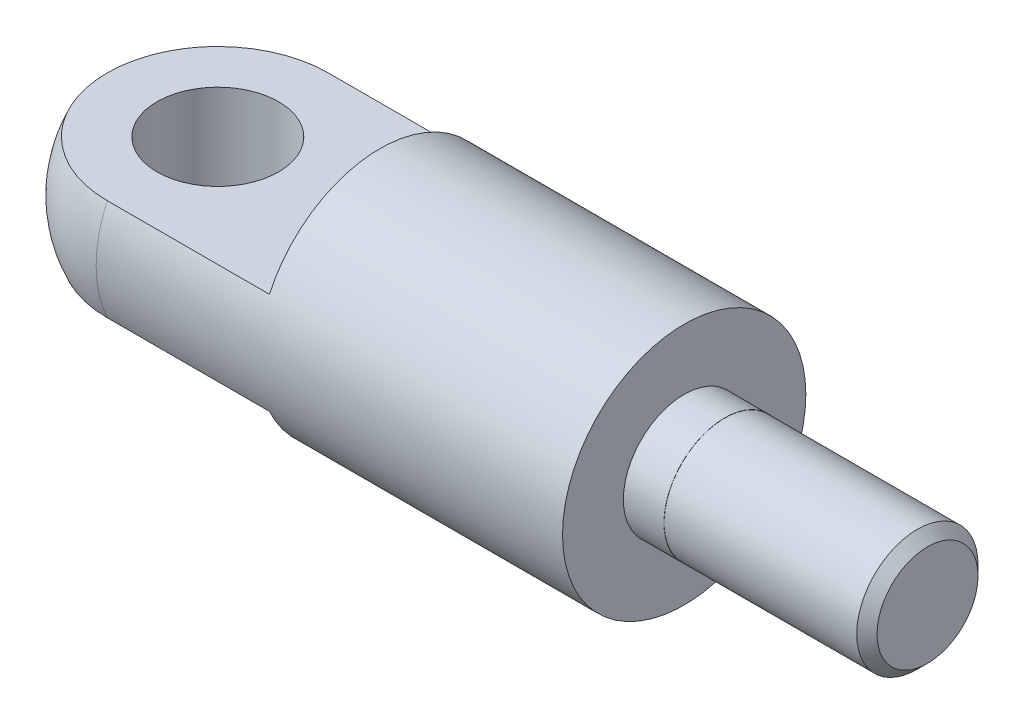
ISO-10303-21;
HEADER;
FILE_DESCRIPTION(('STEP AP214'),'2;1');
FILE_NAME('part.step','',(''),(''),'','','');
FILE_SCHEMA(('AUTOMOTIVE_DESIGN { 1 0 10303 214 1 1 1 1 }'));
ENDSEC;
DATA;
#1=APPLICATION_CONTEXT('core data for automotive mechanical design processes');
#2=APPLICATION_PROTOCOL_DEFINITION('international standard','automotive_design',2000,#1);
#3=PRODUCT_CONTEXT('',#1,'mechanical');
#4=PRODUCT('Part','Part','',(#3));
#5=PRODUCT_RELATED_PRODUCT_CATEGORY('part','',(#4));
#6=PRODUCT_DEFINITION_FORMATION('','',#4);
#7=PRODUCT_DEFINITION_CONTEXT('part definition',#1,'design');
#8=PRODUCT_DEFINITION('design','',#6,#7);
#9=PRODUCT_DEFINITION_SHAPE('','',#8);
#10=(LENGTH_UNIT() NAMED_UNIT(*) SI_UNIT(.MILLI.,.METRE.));
#11=(NAMED_UNIT(*) PLANE_ANGLE_UNIT() SI_UNIT($,.RADIAN.));
#12=(NAMED_UNIT(*) SI_UNIT($,.STERADIAN.) SOLID_ANGLE_UNIT());
#13=UNCERTAINTY_MEASURE_WITH_UNIT(LENGTH_MEASURE(1.E-05),#10,'distance_accuracy_value','');
#14=(GEOMETRIC_REPRESENTATION_CONTEXT(3) GLOBAL_UNCERTAINTY_ASSIGNED_CONTEXT((#13)) GLOBAL_UNIT_ASSIGNED_CONTEXT((#10,
#11,#12)) REPRESENTATION_CONTEXT('',''));
#15=CARTESIAN_POINT('',(0.,0.,0.));
#16=DIRECTION('',(0.,0.,1.));
#17=DIRECTION('',(1.,0.,0.));
#18=AXIS2_PLACEMENT_3D('',#15,#16,#17);
#19=CARTESIAN_POINT('',(0.,0.,0.));
#20=DIRECTION('',(-1.,0.,0.));
#21=DIRECTION('',(0.,0.,1.));
#22=AXIS2_PLACEMENT_3D('',#19,#20,#21);
#23=CYLINDRICAL_SURFACE('',#22,2.99999999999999);
#24=CARTESIAN_POINT('',(29.,0.,0.));
#25=DIRECTION('',(-1.,0.,0.));
#26=DIRECTION('',(0.,0.,1.));
#27=AXIS2_PLACEMENT_3D('',#24,#25,#26);
#28=CIRCLE('',#27,2.99999999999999);
#29=CARTESIAN_POINT('',(29.,0.,2.99999999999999));
#30=VERTEX_POINT('',#29);
#31=EDGE_CURVE('E173',#30,#30,#28,.T.);
#32=ORIENTED_EDGE('',*,*,#31,.F.);
#33=EDGE_LOOP('',(#32));
#34=FACE_BOUND('',#33,.T.);
#35=CARTESIAN_POINT('',(31.,0.,0.));
#36=DIRECTION('',(1.,0.,0.));
#37=DIRECTION('',(0.,0.,-1.));
#38=AXIS2_PLACEMENT_3D('',#35,#36,#37);
#39=CIRCLE('',#38,2.99999999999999);
#40=CARTESIAN_POINT('',(31.,0.,-2.99999999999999));
#41=VERTEX_POINT('',#40);
#42=EDGE_CURVE('E95',#41,#41,#39,.T.);
#43=ORIENTED_EDGE('',*,*,#42,.F.);
#44=EDGE_LOOP('',(#43));
#45=FACE_BOUND('',#44,.T.);
#46=ADVANCED_FACE('F32',(#34,#45),#23,.T.);
#47=CARTESIAN_POINT('',(6.,0.,0.));
#48=DIRECTION('',(-1.,0.,0.));
#49=DIRECTION('',(0.,0.,-1.));
#50=AXIS2_PLACEMENT_3D('',#47,#48,#49);
#51=SPHERICAL_SURFACE('',#50,6.);
#52=CARTESIAN_POINT('',(6.,0.,0.));
#53=DIRECTION('',(-1.,0.,0.));
#54=DIRECTION('',(0.,0.,1.));
#55=AXIS2_PLACEMENT_3D('',#52,#53,#54);
#56=CIRCLE('',#55,5.99999999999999);
#57=CARTESIAN_POINT('',(6.,-2.5,5.45435605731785));
#58=VERTEX_POINT('',#57);
#59=CARTESIAN_POINT('',(6.,2.5,5.45435605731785));
#60=VERTEX_POINT('',#59);
#61=EDGE_CURVE('E168',#58,#60,#56,.T.);
#62=ORIENTED_EDGE('',*,*,#61,.T.);
#63=CARTESIAN_POINT('',(6.,2.5,0.));
#64=DIRECTION('',(0.,-1.,0.));
#65=DIRECTION('',(0.,0.,-1.));
#66=AXIS2_PLACEMENT_3D('',#63,#64,#65);
#67=CIRCLE('',#66,5.45435605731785);
#68=CARTESIAN_POINT('',(6.,2.5,-5.45435605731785));
#69=VERTEX_POINT('',#68);
#70=EDGE_CURVE('E74',#60,#69,#67,.T.);
#71=ORIENTED_EDGE('',*,*,#70,.T.);
#72=CARTESIAN_POINT('',(6.,-2.5,-5.45435605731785));
#73=VERTEX_POINT('',#72);
#74=EDGE_CURVE('E167',#69,#73,#56,.T.);
#75=ORIENTED_EDGE('',*,*,#74,.T.);
#76=CARTESIAN_POINT('',(6.,-2.5,0.));
#77=DIRECTION('',(0.,1.,0.));
#78=DIRECTION('',(0.,0.,1.));
#79=AXIS2_PLACEMENT_3D('',#76,#77,#78);
#80=CIRCLE('',#79,5.45435605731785);
#81=EDGE_CURVE('E164',#73,#58,#80,.T.);
#82=ORIENTED_EDGE('',*,*,#81,.T.);
#83=EDGE_LOOP('',(#62,#71,#75,#82));
#84=FACE_BOUND('',#83,.T.);
#85=ADVANCED_FACE('F113',(#84),#51,.T.);
#86=CARTESIAN_POINT('',(29.,0.,-2.99999999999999));
#87=DIRECTION('',(-1.,0.,0.));
#88=DIRECTION('',(0.,0.,1.));
#89=AXIS2_PLACEMENT_3D('',#86,#87,#88);
#90=PLANE('',#89);
#91=CARTESIAN_POINT('',(29.,0.,0.));
#92=DIRECTION('',(-1.,0.,0.));
#93=DIRECTION('',(0.,0.,1.));
#94=AXIS2_PLACEMENT_3D('',#91,#92,#93);
#95=CIRCLE('',#94,5.99999999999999);
#96=CARTESIAN_POINT('',(29.,0.,5.99999999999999));
#97=VERTEX_POINT('',#96);
#98=EDGE_CURVE('E170',#97,#97,#95,.T.);
#99=ORIENTED_EDGE('',*,*,#98,.F.);
#100=EDGE_LOOP('',(#99));
#101=FACE_BOUND('',#100,.T.);
#102=ORIENTED_EDGE('',*,*,#31,.T.);
#103=EDGE_LOOP('',(#102));
#104=FACE_BOUND('',#103,.T.);
#105=ADVANCED_FACE('F119',(#101,#104),#90,.F.);
#106=CARTESIAN_POINT('',(0.,0.,0.));
#107=DIRECTION('',(-1.,0.,0.));
#108=DIRECTION('',(0.,0.,1.));
#109=AXIS2_PLACEMENT_3D('',#106,#107,#108);
#110=CYLINDRICAL_SURFACE('',#109,5.99999999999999);
#111=CARTESIAN_POINT('',(14.,0.,0.));
#112=DIRECTION('',(1.,0.,0.));
#113=DIRECTION('',(0.,0.,-1.));
#114=AXIS2_PLACEMENT_3D('',#111,#112,#113);
#115=CIRCLE('',#114,5.99999999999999);
#116=CARTESIAN_POINT('',(14.,2.5,-5.45435605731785));
#117=VERTEX_POINT('',#116);
#118=CARTESIAN_POINT('',(14.,2.5,5.45435605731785));
#119=VERTEX_POINT('',#118);
#120=EDGE_CURVE('E79',#117,#119,#115,.T.);
#121=ORIENTED_EDGE('',*,*,#120,.T.);
#122=DIRECTION('',(-1.,0.,0.));
#123=VECTOR('',#122,1.);
#124=CARTESIAN_POINT('',(0.,2.5,5.45435605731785));
#125=LINE('',#124,#123);
#126=EDGE_CURVE('E71',#119,#60,#125,.T.);
#127=ORIENTED_EDGE('',*,*,#126,.T.);
#128=ORIENTED_EDGE('',*,*,#61,.F.);
#129=DIRECTION('',(-1.,0.,0.));
#130=VECTOR('',#129,1.);
#131=CARTESIAN_POINT('',(0.,-2.5,5.45435605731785));
#132=LINE('',#131,#130);
#133=CARTESIAN_POINT('',(14.,-2.5,5.45435605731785));
#134=VERTEX_POINT('',#133);
#135=EDGE_CURVE('E179',#58,#134,#132,.F.);
#136=ORIENTED_EDGE('',*,*,#135,.T.);
#137=CARTESIAN_POINT('',(14.,0.,0.));
#138=DIRECTION('',(1.,0.,0.));
#139=DIRECTION('',(0.,0.,-1.));
#140=AXIS2_PLACEMENT_3D('',#137,#138,#139);
#141=CIRCLE('',#140,5.99999999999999);
#142=CARTESIAN_POINT('',(14.,-2.5,-5.45435605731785));
#143=VERTEX_POINT('',#142);
#144=EDGE_CURVE('E176',#134,#143,#141,.T.);
#145=ORIENTED_EDGE('',*,*,#144,.T.);
#146=DIRECTION('',(-1.,0.,0.));
#147=VECTOR('',#146,1.);
#148=CARTESIAN_POINT('',(0.,-2.5,-5.45435605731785));
#149=LINE('',#148,#147);
#150=EDGE_CURVE('E91',#143,#73,#149,.T.);
#151=ORIENTED_EDGE('',*,*,#150,.T.);
#152=ORIENTED_EDGE('',*,*,#74,.F.);
#153=DIRECTION('',(-1.,0.,0.));
#154=VECTOR('',#153,1.);
#155=CARTESIAN_POINT('',(0.,2.5,-5.45435605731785));
#156=LINE('',#155,#154);
#157=EDGE_CURVE('E89',#69,#117,#156,.F.);
#158=ORIENTED_EDGE('',*,*,#157,.T.);
#159=EDGE_LOOP('',(#121,#127,#128,#136,#145,#151,#152,#158));
#160=FACE_BOUND('',#159,.T.);
#161=ORIENTED_EDGE('',*,*,#98,.T.);
#162=EDGE_LOOP('',(#161));
#163=FACE_BOUND('',#162,.T.);
#164=ADVANCED_FACE('F86',(#160,#163),#110,.T.);
#165=CARTESIAN_POINT('',(0.,-2.5,-10.));
#166=DIRECTION('',(0.,1.,0.));
#167=DIRECTION('',(0.,0.,1.));
#168=AXIS2_PLACEMENT_3D('',#165,#166,#167);
#169=PLANE('',#168);
#170=CARTESIAN_POINT('',(6.,-2.5,0.));
#171=DIRECTION('',(0.,1.,0.));
#172=DIRECTION('',(0.,0.,1.));
#173=AXIS2_PLACEMENT_3D('',#170,#171,#172);
#174=CIRCLE('',#173,3.);
#175=CARTESIAN_POINT('',(6.,-2.5,3.));
#176=VERTEX_POINT('',#175);
#177=EDGE_CURVE('E84',#176,#176,#174,.T.);
#178=ORIENTED_EDGE('',*,*,#177,.T.);
#179=EDGE_LOOP('',(#178));
#180=FACE_BOUND('',#179,.T.);
#181=DIRECTION('',(0.,0.,1.));
#182=VECTOR('',#181,1.);
#183=CARTESIAN_POINT('',(14.,-2.5,-10.));
#184=LINE('',#183,#182);
#185=EDGE_CURVE('E54',#143,#134,#184,.T.);
#186=ORIENTED_EDGE('',*,*,#185,.T.);
#187=ORIENTED_EDGE('',*,*,#135,.F.);
#188=ORIENTED_EDGE('',*,*,#81,.F.);
#189=ORIENTED_EDGE('',*,*,#150,.F.);
#190=EDGE_LOOP('',(#186,#187,#188,#189));
#191=FACE_BOUND('',#190,.T.);
#192=ADVANCED_FACE('F129',(#180,#191),#169,.F.);
#193=CARTESIAN_POINT('',(14.,-2.5,-10.));
#194=DIRECTION('',(1.,0.,0.));
#195=DIRECTION('',(0.,0.,-1.));
#196=AXIS2_PLACEMENT_3D('',#193,#194,#195);
#197=PLANE('',#196);
#198=ORIENTED_EDGE('',*,*,#185,.F.);
#199=ORIENTED_EDGE('',*,*,#144,.F.);
#200=EDGE_LOOP('',(#198,#199));
#201=FACE_BOUND('',#200,.T.);
#202=ADVANCED_FACE('F130',(#201),#197,.F.);
#203=CARTESIAN_POINT('',(14.,2.5,-10.));
#204=DIRECTION('',(1.,0.,0.));
#205=DIRECTION('',(0.,0.,-1.));
#206=AXIS2_PLACEMENT_3D('',#203,#204,#205);
#207=PLANE('',#206);
#208=DIRECTION('',(0.,0.,1.));
#209=VECTOR('',#208,1.);
#210=CARTESIAN_POINT('',(14.,2.5,-10.));
#211=LINE('',#210,#209);
#212=EDGE_CURVE('E47',#117,#119,#211,.T.);
#213=ORIENTED_EDGE('',*,*,#212,.T.);
#214=ORIENTED_EDGE('',*,*,#120,.F.);
#215=EDGE_LOOP('',(#213,#214));
#216=FACE_BOUND('',#215,.T.);
#217=ADVANCED_FACE('F82',(#216),#207,.F.);
#218=CARTESIAN_POINT('',(0.,2.5,-10.));
#219=DIRECTION('',(0.,-1.,0.));
#220=DIRECTION('',(0.,0.,-1.));
#221=AXIS2_PLACEMENT_3D('',#218,#219,#220);
#222=PLANE('',#221);
#223=CARTESIAN_POINT('',(6.,2.5,0.));
#224=DIRECTION('',(0.,1.,0.));
#225=DIRECTION('',(0.,0.,1.));
#226=AXIS2_PLACEMENT_3D('',#223,#224,#225);
#227=CIRCLE('',#226,3.);
#228=CARTESIAN_POINT('',(6.,2.5,3.));
#229=VERTEX_POINT('',#228);
#230=EDGE_CURVE('E97',#229,#229,#227,.T.);
#231=ORIENTED_EDGE('',*,*,#230,.F.);
#232=EDGE_LOOP('',(#231));
#233=FACE_BOUND('',#232,.T.);
#234=ORIENTED_EDGE('',*,*,#212,.F.);
#235=ORIENTED_EDGE('',*,*,#157,.F.);
#236=ORIENTED_EDGE('',*,*,#70,.F.);
#237=ORIENTED_EDGE('',*,*,#126,.F.);
#238=EDGE_LOOP('',(#234,#235,#236,#237));
#239=FACE_BOUND('',#238,.T.);
#240=ADVANCED_FACE('F72',(#233,#239),#222,.F.);
#241=CARTESIAN_POINT('',(6.,-17.5,0.));
#242=DIRECTION('',(0.,1.,0.));
#243=DIRECTION('',(0.,0.,1.));
#244=AXIS2_PLACEMENT_3D('',#241,#242,#243);
#245=CYLINDRICAL_SURFACE('',#244,3.);
#246=ORIENTED_EDGE('',*,*,#230,.T.);
#247=EDGE_LOOP('',(#246));
#248=FACE_BOUND('',#247,.T.);
#249=ORIENTED_EDGE('',*,*,#177,.F.);
#250=EDGE_LOOP('',(#249));
#251=FACE_BOUND('',#250,.T.);
#252=ADVANCED_FACE('F138',(#248,#251),#245,.F.);
#253=CARTESIAN_POINT('',(31.,0.,0.));
#254=DIRECTION('',(1.,0.,0.));
#255=DIRECTION('',(0.,0.,-1.));
#256=AXIS2_PLACEMENT_3D('',#253,#254,#255);
#257=PLANE('',#256);
#258=CARTESIAN_POINT('',(31.,0.,0.));
#259=DIRECTION('',(1.,0.,0.));
#260=DIRECTION('',(0.,0.,-1.));
#261=AXIS2_PLACEMENT_3D('',#258,#259,#260);
#262=CIRCLE('',#261,2.99);
#263=CARTESIAN_POINT('',(31.,0.,-2.99));
#264=VERTEX_POINT('',#263);
#265=EDGE_CURVE('E98',#264,#264,#262,.T.);
#266=ORIENTED_EDGE('',*,*,#265,.F.);
#267=EDGE_LOOP('',(#266));
#268=FACE_BOUND('',#267,.T.);
#269=ORIENTED_EDGE('',*,*,#42,.T.);
#270=EDGE_LOOP('',(#269));
#271=FACE_BOUND('',#270,.T.);
#272=ADVANCED_FACE('F144',(#268,#271),#257,.T.);
#273=CARTESIAN_POINT('',(31.,0.,0.));
#274=DIRECTION('',(1.,0.,0.));
#275=DIRECTION('',(0.,0.,-1.));
#276=AXIS2_PLACEMENT_3D('',#273,#274,#275);
#277=CYLINDRICAL_SURFACE('',#276,2.99);
#278=CARTESIAN_POINT('',(40.5,0.,0.));
#279=DIRECTION('',(-1.,0.,0.));
#280=DIRECTION('',(0.,0.,1.));
#281=AXIS2_PLACEMENT_3D('',#278,#279,#280);
#282=CIRCLE('',#281,2.99);
#283=CARTESIAN_POINT('',(40.5,0.,2.99));
#284=VERTEX_POINT('',#283);
#285=EDGE_CURVE('E11',#284,#284,#282,.T.);
#286=ORIENTED_EDGE('',*,*,#285,.T.);
#287=EDGE_LOOP('',(#286));
#288=FACE_BOUND('',#287,.T.);
#289=ORIENTED_EDGE('',*,*,#265,.T.);
#290=EDGE_LOOP('',(#289));
#291=FACE_BOUND('',#290,.T.);
#292=ADVANCED_FACE('F109',(#288,#291),#277,.T.);
#293=CARTESIAN_POINT('',(41.,0.,0.));
#294=DIRECTION('',(-1.,0.,0.));
#295=DIRECTION('',(0.,0.,1.));
#296=AXIS2_PLACEMENT_3D('',#293,#294,#295);
#297=PLANE('',#296);
#298=CARTESIAN_POINT('',(41.,0.,0.));
#299=DIRECTION('',(-1.,0.,0.));
#300=DIRECTION('',(0.,0.,1.));
#301=AXIS2_PLACEMENT_3D('',#298,#299,#300);
#302=CIRCLE('',#301,2.49000000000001);
#303=CARTESIAN_POINT('',(41.,0.,2.49000000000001));
#304=VERTEX_POINT('',#303);
#305=EDGE_CURVE('E40',#304,#304,#302,.F.);
#306=ORIENTED_EDGE('',*,*,#305,.T.);
#307=EDGE_LOOP('',(#306));
#308=FACE_BOUND('',#307,.T.);
#309=ADVANCED_FACE('F102',(#308),#297,.F.);
#310=CARTESIAN_POINT('',(41.,0.,0.));
#311=DIRECTION('',(-1.,0.,0.));
#312=DIRECTION('',(0.,0.,1.));
#313=AXIS2_PLACEMENT_3D('',#310,#311,#312);
#314=CONICAL_SURFACE('',#313,2.49000000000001,0.785398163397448);
#315=ORIENTED_EDGE('',*,*,#285,.F.);
#316=EDGE_LOOP('',(#315));
#317=FACE_BOUND('',#316,.T.);
#318=ORIENTED_EDGE('',*,*,#305,.F.);
#319=EDGE_LOOP('',(#318));
#320=FACE_BOUND('',#319,.T.);
#321=ADVANCED_FACE('F34',(#317,#320),#314,.T.);
#322=CLOSED_SHELL('',(#46,#85,#105,#164,#192,#202,#217,#240,#252,#272,#292,#309,#321));
#323=MANIFOLD_SOLID_BREP('B2',#322);
#324=ADVANCED_BREP_SHAPE_REPRESENTATION('',(#18,#323),#14);
#325=SHAPE_DEFINITION_REPRESENTATION(#9,#324);
ENDSEC;
END-ISO-10303-21;
